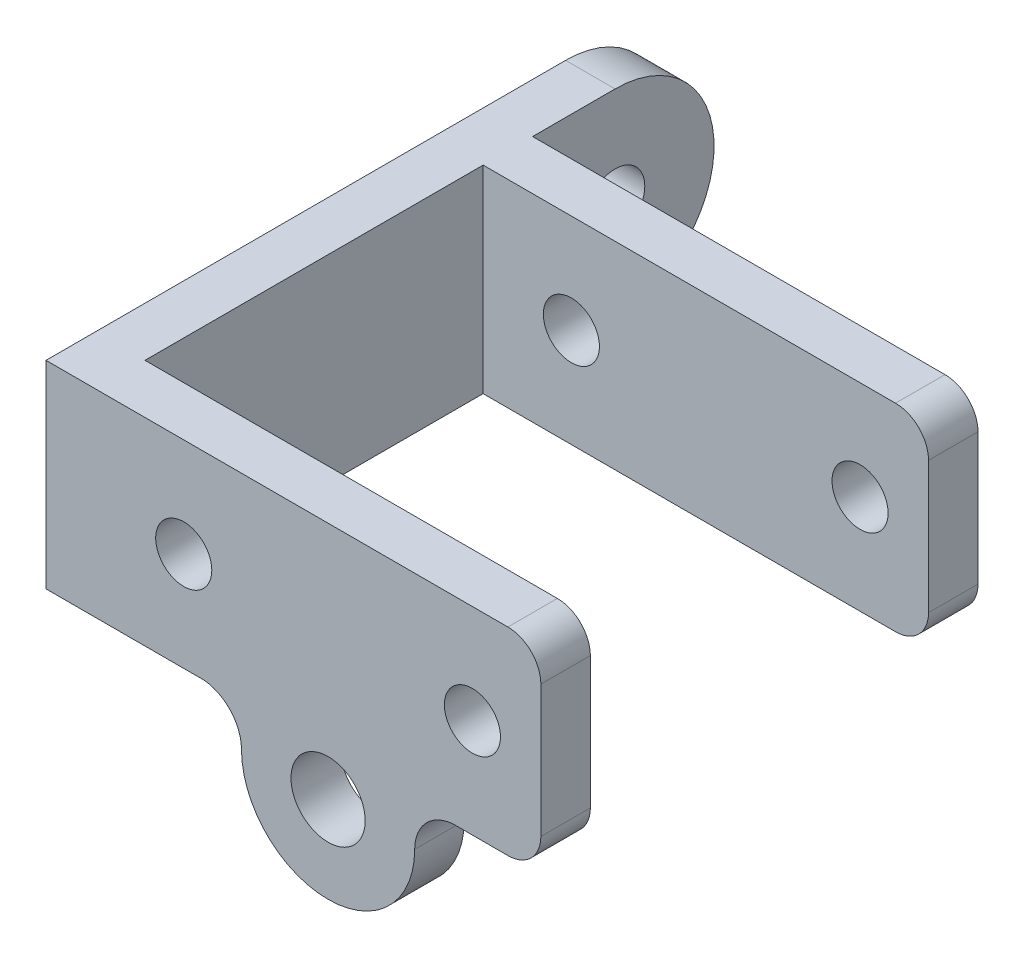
from build123d import *

# Parameters (mm, degrees)
SKETCH_2_W          = 30
SKETCH_2_H          = 12
EXTRUDE_1_DEPTH     = 26.5
SHELL_2_T           = -3
SKETCH_4_R          = 1.7
CUT_EXTRUDE_2_DEPTH = 32.036269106
EXTRUDE_START       = -3
EXTRUDE_2_DEPTH     = 3
SKETCH_5_R          = 2.25
CUT_EXTRUDE_3_DEPTH = 3
SKETCH_7_R          = 1.8
EXTRUDE_3_DEPTH     = 3
FILLET_1_R          = 2


with BuildPart() as part:
    # Sketch 2 → Extrude 1 (new body)
    with BuildSketch(Plane.XY):
        Rectangle(SKETCH_2_W, SKETCH_2_H)
    extrude(amount=EXTRUDE_1_DEPTH)

    # Shell 2
    shell_2_openings = [part.faces().sort_by_distance(p)[0] for p in [
        (0, -6, 13.25),
        (0, 6, 13.25),
        (15, 0, 13.25),
    ]]
    offset(amount=SHELL_2_T, openings=shell_2_openings, kind=Kind.INTERSECTION)

    # Sketch 4 → Cut-Extrude 2 (cut, through all)
    with BuildSketch(Plane.XY.offset(26.5)):
        with Locations((-6.65, 0)):
            Circle(SKETCH_4_R)
        with Locations((10.85, 0)):
            Circle(SKETCH_4_R)
    extrude(amount=-CUT_EXTRUDE_2_DEPTH, mode=Mode.SUBTRACT)

    # Sketch 6 → Extrude 2 (add)
    with BuildSketch(Plane.XY.offset(26.5).offset(EXTRUDE_START)):
        with BuildLine():
            Line((-5.433549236, -6), (9.669144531, -6))
            ThreePointArc((9.669144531, -6), (8.019063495, -6.794975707), (7.35, -8.5))
            ThreePointArc((7.35, -8.5), (2.1, -13.75), (-3.15, -8.5))
            ThreePointArc((-3.15, -8.5), (-3.806816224, -6.807029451), (-5.433549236, -6))
        make_face()
    extrude(amount=EXTRUDE_2_DEPTH)

    # Sketch 5 → Cut-Extrude 3 (cut)
    with BuildSketch(Plane.XY.offset(26.5)):
        with Locations((2.1, -8.5)):
            Circle(SKETCH_5_R)
    extrude(amount=-CUT_EXTRUDE_3_DEPTH, mode=Mode.SUBTRACT)

    # Sketch 7 → Extrude 3 (add)
    with BuildSketch(Plane.ZY.offset(15)):
        with BuildLine():
            Line((-5, 6), (0, 6))
            Line((0, 6), (0, -6))
            Line((0, -6), (-5, -6))
            ThreePointArc((-5, -6), (-11, 0), (-5, 6))
        make_face()
        with Locations(Location((-5, 0, 0), (0, 0, 270))):
            Circle(SKETCH_7_R, mode=Mode.SUBTRACT)
    extrude(amount=-EXTRUDE_3_DEPTH)

    # Fillet 1
    fillet_1_edges = [part.edges().sort_by_distance(p)[0] for p in [
        (15, -6, 1.5),
        (15, 6, 1.5),
        (15, -6, 25),
        (15, 6, 25),
    ]]
    fillet(fillet_1_edges, radius=FILLET_1_R)


solid = part.part
